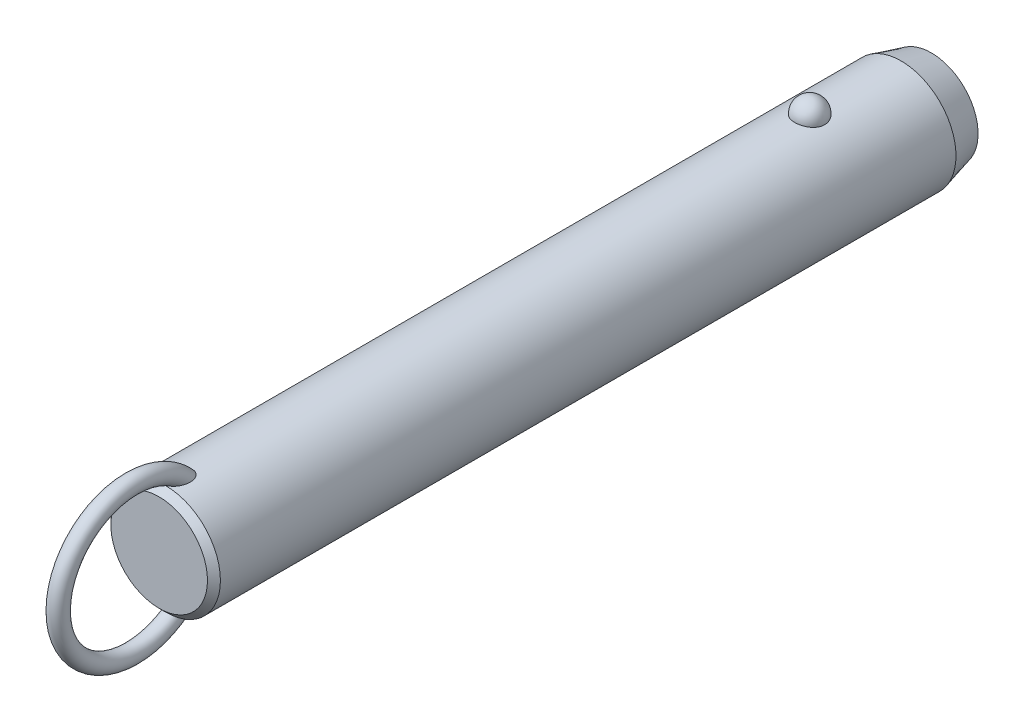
ISO-10303-21;
HEADER;
FILE_DESCRIPTION(('STEP AP214'),'2;1');
FILE_NAME('part.step','',(''),(''),'','','');
FILE_SCHEMA(('AUTOMOTIVE_DESIGN { 1 0 10303 214 1 1 1 1 }'));
ENDSEC;
DATA;
#1=APPLICATION_CONTEXT('core data for automotive mechanical design processes');
#2=APPLICATION_PROTOCOL_DEFINITION('international standard','automotive_design',2000,#1);
#3=PRODUCT_CONTEXT('',#1,'mechanical');
#4=PRODUCT('Part','Part','',(#3));
#5=PRODUCT_RELATED_PRODUCT_CATEGORY('part','',(#4));
#6=PRODUCT_DEFINITION_FORMATION('','',#4);
#7=PRODUCT_DEFINITION_CONTEXT('part definition',#1,'design');
#8=PRODUCT_DEFINITION('design','',#6,#7);
#9=PRODUCT_DEFINITION_SHAPE('','',#8);
#10=(LENGTH_UNIT() NAMED_UNIT(*) SI_UNIT(.MILLI.,.METRE.));
#11=(NAMED_UNIT(*) PLANE_ANGLE_UNIT() SI_UNIT($,.RADIAN.));
#12=(NAMED_UNIT(*) SI_UNIT($,.STERADIAN.) SOLID_ANGLE_UNIT());
#13=UNCERTAINTY_MEASURE_WITH_UNIT(LENGTH_MEASURE(1.E-05),#10,'distance_accuracy_value','');
#14=(GEOMETRIC_REPRESENTATION_CONTEXT(3) GLOBAL_UNCERTAINTY_ASSIGNED_CONTEXT((#13)) GLOBAL_UNIT_ASSIGNED_CONTEXT((#10,
#11,#12)) REPRESENTATION_CONTEXT('',''));
#15=CARTESIAN_POINT('',(0.,0.,0.));
#16=DIRECTION('',(0.,0.,1.));
#17=DIRECTION('',(1.,0.,0.));
#18=AXIS2_PLACEMENT_3D('',#15,#16,#17);
#19=CARTESIAN_POINT('',(0.,0.,134.6));
#20=DIRECTION('',(0.,0.,-1.));
#21=DIRECTION('',(-1.,0.,0.));
#22=AXIS2_PLACEMENT_3D('',#19,#20,#21);
#23=CYLINDRICAL_SURFACE('',#22,12.7);
#24=CARTESIAN_POINT('',(3.46661256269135,12.2177165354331,-3.5));
#25=CARTESIAN_POINT('',(3.4666090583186,12.2177194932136,-3.30432790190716));
#26=CARTESIAN_POINT('',(3.45063567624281,12.2222841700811,-3.10861112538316));
#27=CARTESIAN_POINT('',(3.38712451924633,12.2400345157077,-2.72271899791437));
#28=CARTESIAN_POINT('',(3.33957415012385,12.2532236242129,-2.53254588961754));
#29=CARTESIAN_POINT('',(3.2141234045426,12.286724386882,-2.16324948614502));
#30=CARTESIAN_POINT('',(3.13623639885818,12.3070329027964,-1.98412136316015));
#31=CARTESIAN_POINT('',(2.95205930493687,12.3525018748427,-1.64180592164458));
#32=CARTESIAN_POINT('',(2.84577003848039,12.3776621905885,-1.47861814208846));
#33=CARTESIAN_POINT('',(2.60688050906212,12.4301712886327,-1.17190583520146));
#34=CARTESIAN_POINT('',(2.47415697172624,12.4575299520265,-1.02847897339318));
#35=CARTESIAN_POINT('',(2.18615174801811,12.5112810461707,-0.766177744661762));
#36=CARTESIAN_POINT('',(2.03087002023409,12.5376734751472,-0.64730342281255));
#37=CARTESIAN_POINT('',(1.70237334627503,12.5864761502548,-0.437732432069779));
#38=CARTESIAN_POINT('',(1.52920948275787,12.6088972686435,-0.346958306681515));
#39=CARTESIAN_POINT('',(1.16944170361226,12.6473352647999,-0.195750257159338));
#40=CARTESIAN_POINT('',(0.982839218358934,12.663352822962,-0.135313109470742));
#41=CARTESIAN_POINT('',(0.604961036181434,12.6869706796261,-0.0473241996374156));
#42=CARTESIAN_POINT('',(0.41382314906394,12.6947125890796,-0.0192185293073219));
#43=CARTESIAN_POINT('',(0.0293827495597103,12.7014203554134,0.0051725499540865));
#44=CARTESIAN_POINT('',(-0.163919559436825,12.7003870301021,0.00146092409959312));
#45=CARTESIAN_POINT('',(-0.544374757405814,12.689735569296,-0.0373939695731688));
#46=CARTESIAN_POINT('',(-0.731575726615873,12.6802364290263,-0.0721015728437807));
#47=CARTESIAN_POINT('',(-1.09733277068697,12.6538333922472,-0.171364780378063));
#48=CARTESIAN_POINT('',(-1.27588869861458,12.6369293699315,-0.235920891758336));
#49=CARTESIAN_POINT('',(-1.6204698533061,12.5973946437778,-0.393548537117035));
#50=CARTESIAN_POINT('',(-1.78641865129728,12.5747321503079,-0.486778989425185));
#51=CARTESIAN_POINT('',(-2.10030671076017,12.5261316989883,-0.699110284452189));
#52=CARTESIAN_POINT('',(-2.24824419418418,12.5001934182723,-0.818213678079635));
#53=CARTESIAN_POINT('',(-2.52491489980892,12.4472906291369,-1.08157124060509));
#54=CARTESIAN_POINT('',(-2.65324222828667,12.4203160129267,-1.22624992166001));
#55=CARTESIAN_POINT('',(-2.88410007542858,12.3687509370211,-1.53528325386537));
#56=CARTESIAN_POINT('',(-2.98662883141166,12.3441606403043,-1.69963924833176));
#57=CARTESIAN_POINT('',(-3.16432417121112,12.2998199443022,-2.04548497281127));
#58=CARTESIAN_POINT('',(-3.23917525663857,12.2801261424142,-2.22714424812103));
#59=CARTESIAN_POINT('',(-3.35800573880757,12.248167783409,-2.6009138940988));
#60=CARTESIAN_POINT('',(-3.4019860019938,12.2359030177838,-2.79302397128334));
#61=CARTESIAN_POINT('',(-3.45784812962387,12.2202347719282,-3.18140279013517));
#62=CARTESIAN_POINT('',(-3.46986123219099,12.2167950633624,-3.37765118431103));
#63=CARTESIAN_POINT('',(-3.46186273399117,12.2190638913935,-3.76943689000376));
#64=CARTESIAN_POINT('',(-3.44185196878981,12.2247721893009,-3.96497421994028));
#65=CARTESIAN_POINT('',(-3.37048652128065,12.2446381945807,-4.34881728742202));
#66=CARTESIAN_POINT('',(-3.31928253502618,12.2587552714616,-4.53715319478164));
#67=CARTESIAN_POINT('',(-3.18693461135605,12.2938237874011,-4.90231727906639));
#68=CARTESIAN_POINT('',(-3.1057895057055,12.3147754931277,-5.07914500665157));
#69=CARTESIAN_POINT('',(-2.91506431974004,12.3613125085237,-5.41732059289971));
#70=CARTESIAN_POINT('',(-2.80533587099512,12.3869217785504,-5.57858147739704));
#71=CARTESIAN_POINT('',(-2.560414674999,12.4398525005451,-5.88013283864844));
#72=CARTESIAN_POINT('',(-2.42522099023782,12.4671740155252,-6.02042254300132));
#73=CARTESIAN_POINT('',(-2.1323357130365,12.5205965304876,-6.27662798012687));
#74=CARTESIAN_POINT('',(-1.97456596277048,12.5466928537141,-6.3924554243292));
#75=CARTESIAN_POINT('',(-1.64115839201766,12.5946384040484,-6.59583547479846));
#76=CARTESIAN_POINT('',(-1.46552179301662,12.6164879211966,-6.68339001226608));
#77=CARTESIAN_POINT('',(-1.10356050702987,12.6532533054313,-6.82682153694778));
#78=CARTESIAN_POINT('',(-0.9173913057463,12.6682500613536,-6.8830698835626));
#79=CARTESIAN_POINT('',(-0.537836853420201,12.6900288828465,-6.96386887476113));
#80=CARTESIAN_POINT('',(-0.344452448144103,12.6968119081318,-6.9884232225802));
#81=CARTESIAN_POINT('',(0.0402577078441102,12.7013667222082,-7.00496469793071));
#82=CARTESIAN_POINT('',(0.231556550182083,12.6993008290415,-6.99753844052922));
#83=CARTESIAN_POINT('',(0.610105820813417,12.6867505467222,-6.9516636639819));
#84=CARTESIAN_POINT('',(0.797356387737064,12.6762664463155,-6.913216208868));
#85=CARTESIAN_POINT('',(1.16186657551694,12.6480587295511,-6.80658431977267));
#86=CARTESIAN_POINT('',(1.33915951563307,12.6303611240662,-6.73850666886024));
#87=CARTESIAN_POINT('',(1.67968518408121,12.5896027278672,-6.5745087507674));
#88=CARTESIAN_POINT('',(1.84291705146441,12.5665416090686,-6.47858678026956));
#89=CARTESIAN_POINT('',(2.15340192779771,12.5171072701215,-6.25982455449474));
#90=CARTESIAN_POINT('',(2.30037831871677,12.4906895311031,-6.13660186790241));
#91=CARTESIAN_POINT('',(2.5717412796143,12.4376567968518,-5.86739587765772));
#92=CARTESIAN_POINT('',(2.69612388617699,12.4110417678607,-5.72140858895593));
#93=CARTESIAN_POINT('',(2.92107785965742,12.360051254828,-5.40794137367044));
#94=CARTESIAN_POINT('',(3.02121329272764,12.3357209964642,-5.24014110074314));
#95=CARTESIAN_POINT('',(3.19236291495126,12.2925446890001,-4.88969865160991));
#96=CARTESIAN_POINT('',(3.26338839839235,12.2736965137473,-4.70706226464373));
#97=CARTESIAN_POINT('',(3.36788038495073,12.245404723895,-4.35469510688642));
#98=CARTESIAN_POINT('',(3.40484026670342,12.2351018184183,-4.18605935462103));
#99=CARTESIAN_POINT('',(3.45420764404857,12.2212564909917,-3.84496058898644));
#100=CARTESIAN_POINT('',(3.46661565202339,12.2177139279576,-3.67249765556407));
#101=CARTESIAN_POINT('',(3.46661256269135,12.2177165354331,-3.5));
#102=B_SPLINE_CURVE_WITH_KNOTS('',3,(#24,#25,#26,#27,#28,#29,#30,#31,#32,#33,#34,#35,#36,#37,
#38,#39,#40,#41,#42,#43,#44,#45,#46,#47,#48,#49,#50,#51,#52,#53,#54,#55,#56,#57,#58,#59,#60,#61,
#62,#63,#64,#65,#66,#67,#68,#69,#70,#71,#72,#73,#74,#75,#76,#77,#78,#79,#80,#81,#82,#83,#84,#85,
#86,#87,#88,#89,#90,#91,#92,#93,#94,#95,#96,#97,#98,#99,#100,#101),.UNSPECIFIED.,.T.,.F.,(4,2,2,
2,2,2,2,2,2,2,2,2,2,2,2,2,2,2,2,2,2,2,2,2,2,2,2,2,2,2,2,2,2,2,2,2,2,2,4),(0.,0.586396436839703,
1.17302689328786,1.7593990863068,2.34575431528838,2.93491084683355,3.52406845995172,
4.11158733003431,4.69904375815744,5.2762784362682,5.85345931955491,6.42265312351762,
6.99185659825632,7.56427334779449,8.136746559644,8.71981013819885,9.3029135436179,
9.89247258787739,10.4820150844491,11.0691335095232,11.6562366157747,12.2405256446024,
12.8248374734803,13.412244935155,13.9996740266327,14.5891883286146,15.1786623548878,
15.7609861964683,16.3432419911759,16.9148635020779,17.4864654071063,18.0560241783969,
18.6256177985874,19.2037609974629,19.7820055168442,20.3699810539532,20.957728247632,
21.4746855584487,21.9916320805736),.UNSPECIFIED.);
#103=CARTESIAN_POINT('',(3.46661256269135,12.2177165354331,-3.5));
#104=VERTEX_POINT('',#103);
#105=EDGE_CURVE('E41',#104,#104,#102,.T.);
#106=ORIENTED_EDGE('',*,*,#105,.T.);
#107=EDGE_LOOP('',(#106));
#108=FACE_BOUND('',#107,.T.);
#109=CARTESIAN_POINT('',(0.,0.,145.8));
#110=DIRECTION('',(0.,0.,1.));
#111=DIRECTION('',(1.,0.,0.));
#112=AXIS2_PLACEMENT_3D('',#109,#110,#111);
#113=CIRCLE('',#112,12.7);
#114=CARTESIAN_POINT('',(12.7,0.,145.8));
#115=VERTEX_POINT('',#114);
#116=EDGE_CURVE('E10',#115,#115,#113,.F.);
#117=ORIENTED_EDGE('',*,*,#116,.T.);
#118=EDGE_LOOP('',(#117));
#119=FACE_BOUND('',#118,.T.);
#120=CARTESIAN_POINT('',(-0.548122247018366,-12.6881662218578,139.543218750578));
#121=CARTESIAN_POINT('',(-0.648865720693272,-12.6838128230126,139.577926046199));
#122=CARTESIAN_POINT('',(-0.746398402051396,-12.6783867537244,139.622042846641));
#123=CARTESIAN_POINT('',(-0.932125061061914,-12.666091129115,139.726764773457));
#124=CARTESIAN_POINT('',(-1.02030388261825,-12.6592192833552,139.787396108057));
#125=CARTESIAN_POINT('',(-1.18487740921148,-12.6448747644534,139.921847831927));
#126=CARTESIAN_POINT('',(-1.26134296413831,-12.637406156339,139.995582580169));
#127=CARTESIAN_POINT('',(-1.4023120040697,-12.6225412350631,140.153604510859));
#128=CARTESIAN_POINT('',(-1.466814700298,-12.6151449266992,140.23789238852));
#129=CARTESIAN_POINT('',(-1.60714786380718,-12.5981718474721,140.449657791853));
#130=CARTESIAN_POINT('',(-1.67725126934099,-12.588900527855,140.580962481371));
#131=CARTESIAN_POINT('',(-1.79536591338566,-12.5725964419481,140.853247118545));
#132=CARTESIAN_POINT('',(-1.84333535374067,-12.5655679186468,140.994244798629));
#133=CARTESIAN_POINT('',(-1.93422576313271,-12.5519624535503,141.337645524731));
#134=CARTESIAN_POINT('',(-1.96788773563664,-12.5466298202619,141.542557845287));
#135=CARTESIAN_POINT('',(-1.9941399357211,-12.542463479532,141.851760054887));
#136=CARTESIAN_POINT('',(-1.99883864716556,-12.5417153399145,141.955298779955));
#137=CARTESIAN_POINT('',(-2.00078003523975,-12.5414074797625,142.16245124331));
#138=CARTESIAN_POINT('',(-1.99802449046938,-12.5418474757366,142.266064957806));
#139=CARTESIAN_POINT('',(-1.98336733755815,-12.5441750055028,142.51032076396));
#140=CARTESIAN_POINT('',(-1.96851430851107,-12.5465291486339,142.650780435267));
#141=CARTESIAN_POINT('',(-1.92707089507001,-12.5529612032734,142.929960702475));
#142=CARTESIAN_POINT('',(-1.90047458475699,-12.5570399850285,143.068680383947));
#143=CARTESIAN_POINT('',(-1.8361912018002,-12.5666008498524,143.34341135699));
#144=CARTESIAN_POINT('',(-1.79850828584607,-12.57208240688,143.479423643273));
#145=CARTESIAN_POINT('',(-1.71223796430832,-12.5841228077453,143.747842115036));
#146=CARTESIAN_POINT('',(-1.66365679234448,-12.5906810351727,143.880250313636));
#147=CARTESIAN_POINT('',(-1.5780450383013,-12.6016176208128,144.08548877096));
#148=CARTESIAN_POINT('',(-1.54477252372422,-12.6057501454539,144.159914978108));
#149=CARTESIAN_POINT('',(-1.47424480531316,-12.6141930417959,144.306839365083));
#150=CARTESIAN_POINT('',(-1.436990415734,-12.6185033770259,144.379337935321));
#151=CARTESIAN_POINT('',(-1.35825795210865,-12.6272207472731,144.521892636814));
#152=CARTESIAN_POINT('',(-1.31678520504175,-12.6316276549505,144.591951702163));
#153=CARTESIAN_POINT('',(-1.22917793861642,-12.6404532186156,144.729070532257));
#154=CARTESIAN_POINT('',(-1.18304514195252,-12.6448718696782,144.796131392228));
#155=CARTESIAN_POINT('',(-1.0724641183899,-12.6547893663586,144.943874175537));
#156=CARTESIAN_POINT('',(-1.00642239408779,-12.6602600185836,145.023384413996));
#157=CARTESIAN_POINT('',(-0.864441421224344,-12.6707460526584,145.173169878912));
#158=CARTESIAN_POINT('',(-0.78851691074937,-12.6757620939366,145.243458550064));
#159=CARTESIAN_POINT('',(-0.65221547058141,-12.6833591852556,145.348680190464));
#160=CARTESIAN_POINT('',(-0.59498203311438,-12.6861973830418,145.387624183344));
#161=CARTESIAN_POINT('',(-0.475269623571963,-12.6912445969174,145.456489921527));
#162=CARTESIAN_POINT('',(-0.412800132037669,-12.6934547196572,145.486427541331));
#163=CARTESIAN_POINT('',(-0.295749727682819,-12.6966636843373,145.52975652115));
#164=CARTESIAN_POINT('',(-0.241949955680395,-12.6978134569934,145.545218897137));
#165=CARTESIAN_POINT('',(-0.132508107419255,-12.6994261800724,145.566884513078));
#166=CARTESIAN_POINT('',(-0.0768679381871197,-12.6998898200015,145.573097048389));
#167=CARTESIAN_POINT('',(0.03476966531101,-12.7000752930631,145.575583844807));
#168=CARTESIAN_POINT('',(0.0907676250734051,-12.6997954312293,145.571835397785));
#169=CARTESIAN_POINT('',(0.201283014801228,-12.6985255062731,145.554788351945));
#170=CARTESIAN_POINT('',(0.255799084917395,-12.6975348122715,145.541481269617));
#171=CARTESIAN_POINT('',(0.376042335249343,-12.6946091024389,145.50203792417));
#172=CARTESIAN_POINT('',(0.440950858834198,-12.6924943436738,145.473449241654));
#173=CARTESIAN_POINT('',(0.565350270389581,-12.6875639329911,145.406323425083));
#174=CARTESIAN_POINT('',(0.624828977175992,-12.6847467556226,145.367764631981));
#175=CARTESIAN_POINT('',(0.774116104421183,-12.6767252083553,145.256949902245));
#176=CARTESIAN_POINT('',(0.859449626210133,-12.6711344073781,145.178760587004));
#177=CARTESIAN_POINT('',(1.01789440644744,-12.6593922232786,145.010943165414));
#178=CARTESIAN_POINT('',(1.09096902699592,-12.653239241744,144.921282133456));
#179=CARTESIAN_POINT('',(1.22268793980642,-12.6411674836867,144.740265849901));
#180=CARTESIAN_POINT('',(1.28193986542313,-12.6352572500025,144.649345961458));
#181=CARTESIAN_POINT('',(1.39259777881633,-12.6235401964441,144.462792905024));
#182=CARTESIAN_POINT('',(1.44399707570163,-12.6177334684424,144.367155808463));
#183=CARTESIAN_POINT('',(1.53972870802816,-12.6064093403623,144.172273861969));
#184=CARTESIAN_POINT('',(1.58405262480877,-12.6008922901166,144.073024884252));
#185=CARTESIAN_POINT('',(1.66600705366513,-12.5903187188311,143.871772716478));
#186=CARTESIAN_POINT('',(1.70363651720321,-12.5852622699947,143.769769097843));
#187=CARTESIAN_POINT('',(1.77545379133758,-12.5753406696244,143.554358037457));
#188=CARTESIAN_POINT('',(1.80903453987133,-12.5705328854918,143.440745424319));
#189=CARTESIAN_POINT('',(1.86844163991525,-12.5618400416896,143.211457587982));
#190=CARTESIAN_POINT('',(1.89426665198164,-12.5579551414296,143.095782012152));
#191=CARTESIAN_POINT('',(1.9378546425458,-12.5513030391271,142.863007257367));
#192=CARTESIAN_POINT('',(1.9556264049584,-12.5485346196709,142.745909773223));
#193=CARTESIAN_POINT('',(1.98264463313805,-12.5442934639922,142.510747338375));
#194=CARTESIAN_POINT('',(1.99189298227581,-12.5428204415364,142.39268260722));
#195=CARTESIAN_POINT('',(2.00416068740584,-12.540871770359,142.080622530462));
#196=CARTESIAN_POINT('',(1.99944433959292,-12.541631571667,141.886229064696));
#197=CARTESIAN_POINT('',(1.96113755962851,-12.5476846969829,141.500309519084));
#198=CARTESIAN_POINT('',(1.92758341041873,-12.5529723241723,141.308780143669));
#199=CARTESIAN_POINT('',(1.83934342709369,-12.5661532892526,140.982272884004));
#200=CARTESIAN_POINT('',(1.79215440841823,-12.5730485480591,140.84524997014));
#201=CARTESIAN_POINT('',(1.67676242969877,-12.588958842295,140.580445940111));
#202=CARTESIAN_POINT('',(1.60859050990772,-12.597970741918,140.452651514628));
#203=CARTESIAN_POINT('',(1.46583832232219,-12.6152829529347,140.235800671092));
#204=CARTESIAN_POINT('',(1.39525727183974,-12.6233659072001,140.14410500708));
#205=CARTESIAN_POINT('',(1.23992594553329,-12.6395676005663,139.973485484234));
#206=CARTESIAN_POINT('',(1.15517932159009,-12.6476863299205,139.894558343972));
#207=CARTESIAN_POINT('',(0.971995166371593,-12.6630846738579,139.752643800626));
#208=CARTESIAN_POINT('',(0.873456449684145,-12.6703572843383,139.689784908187));
#209=CARTESIAN_POINT('',(0.665847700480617,-12.6829569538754,139.584487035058));
#210=CARTESIAN_POINT('',(0.556784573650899,-12.688285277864,139.542034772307));
#211=CARTESIAN_POINT('',(0.347338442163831,-12.6956226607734,139.484443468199));
#212=CARTESIAN_POINT('',(0.247759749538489,-12.6979816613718,139.466399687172));
#213=CARTESIAN_POINT('',(0.0470218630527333,-12.7003077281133,139.448600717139));
#214=CARTESIAN_POINT('',(-0.0541350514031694,-12.7002779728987,139.448821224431));
#215=CARTESIAN_POINT('',(-0.221414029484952,-12.6982482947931,139.464363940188));
#216=CARTESIAN_POINT('',(-0.288055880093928,-12.6969033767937,139.474666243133));
#217=CARTESIAN_POINT('',(-0.419599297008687,-12.6932369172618,139.50313489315));
#218=CARTESIAN_POINT('',(-0.484501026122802,-12.6909154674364,139.521300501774));
#219=CARTESIAN_POINT('',(-0.548122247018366,-12.6881662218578,139.543218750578));
#220=B_SPLINE_CURVE_WITH_KNOTS('',3,(#120,#121,#122,#123,#124,#125,#126,#127,#128,#129,#130,
#131,#132,#133,#134,#135,#136,#137,#138,#139,#140,#141,#142,#143,#144,#145,#146,#147,#148,#149,
#150,#151,#152,#153,#154,#155,#156,#157,#158,#159,#160,#161,#162,#163,#164,#165,#166,#167,#168,
#169,#170,#171,#172,#173,#174,#175,#176,#177,#178,#179,#180,#181,#182,#183,#184,#185,#186,#187,
#188,#189,#190,#191,#192,#193,#194,#195,#196,#197,#198,#199,#200,#201,#202,#203,#204,#205,#206,
#207,#208,#209,#210,#211,#212,#213,#214,#215,#216,#217,#218,#219),.UNSPECIFIED.,.T.,.F.,(4,2,2,
2,2,2,2,2,2,2,2,2,2,2,2,2,2,2,2,2,2,2,2,2,2,2,2,2,2,2,2,2,2,2,2,2,2,2,2,2,2,2,2,2,2,2,2,2,2,4),
(0.,0.31964225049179,0.639794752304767,0.957927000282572,1.27608021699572,1.72100165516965,
2.16675988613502,2.78630021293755,3.09705782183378,3.40774128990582,3.83096358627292,
4.25439969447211,4.67767724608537,5.10071330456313,5.34550297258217,5.59024267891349,
5.83467707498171,6.07902143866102,6.38891080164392,6.69834321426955,6.9056091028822,
7.11250749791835,7.27977315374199,7.44687060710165,7.61434932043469,7.78197685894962,
7.99365544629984,8.20579780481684,8.55147335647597,8.89816429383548,9.22375138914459,
9.54961437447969,9.8758622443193,10.202161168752,10.557587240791,10.9130746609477,
11.2681734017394,11.6231936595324,12.2046601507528,12.7853961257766,13.219164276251,
13.6522938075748,13.9989174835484,14.3454519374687,14.6946768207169,15.0436740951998,
15.3457513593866,15.6474266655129,15.8493051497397,16.0511646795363),.UNSPECIFIED.);
#221=CARTESIAN_POINT('',(-0.548122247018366,-12.6881662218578,139.543218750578));
#222=VERTEX_POINT('',#221);
#223=EDGE_CURVE('E59',#222,#222,#220,.T.);
#224=ORIENTED_EDGE('',*,*,#223,.T.);
#225=EDGE_LOOP('',(#224));
#226=FACE_BOUND('',#225,.T.);
#227=CARTESIAN_POINT('',(-0.548122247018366,12.6881662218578,139.543218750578));
#228=CARTESIAN_POINT('',(-0.459436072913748,12.6919968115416,139.512673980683));
#229=CARTESIAN_POINT('',(-0.368189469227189,12.6949996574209,139.489391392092));
#230=CARTESIAN_POINT('',(-0.183024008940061,12.6990186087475,139.458406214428));
#231=CARTESIAN_POINT('',(-0.0891049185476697,12.7000345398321,139.450704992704));
#232=CARTESIAN_POINT('',(0.0987147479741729,12.6999636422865,139.451245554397));
#233=CARTESIAN_POINT('',(0.192615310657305,12.6988761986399,139.459492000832));
#234=CARTESIAN_POINT('',(0.377658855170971,12.6947211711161,139.491551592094));
#235=CARTESIAN_POINT('',(0.468801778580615,12.6916535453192,139.515365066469));
#236=CARTESIAN_POINT('',(0.645809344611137,12.6838788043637,139.57745651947));
#237=CARTESIAN_POINT('',(0.731679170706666,12.6791733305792,139.615720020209));
#238=CARTESIAN_POINT('',(0.896315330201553,12.6686004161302,139.705120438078));
#239=CARTESIAN_POINT('',(0.97508059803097,12.6627328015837,139.756259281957));
#240=CARTESIAN_POINT('',(1.12963655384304,12.6499161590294,139.87367820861));
#241=CARTESIAN_POINT('',(1.20478673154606,12.6429194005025,139.940792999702));
#242=CARTESIAN_POINT('',(1.34448241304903,12.6288282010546,140.08522507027));
#243=CARTESIAN_POINT('',(1.40902173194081,12.621733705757,140.162548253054));
#244=CARTESIAN_POINT('',(1.55208211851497,12.6050877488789,140.359247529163));
#245=CARTESIAN_POINT('',(1.62510490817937,12.5957546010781,140.482654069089));
#246=CARTESIAN_POINT('',(1.7501904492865,12.5789823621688,140.739769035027));
#247=CARTESIAN_POINT('',(1.8022137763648,12.5715468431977,140.873496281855));
#248=CARTESIAN_POINT('',(1.90309965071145,12.5567434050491,141.198351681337));
#249=CARTESIAN_POINT('',(1.94342317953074,12.5504515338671,141.392161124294));
#250=CARTESIAN_POINT('',(1.99332997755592,12.5426147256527,141.78378810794));
#251=CARTESIAN_POINT('',(2.00285305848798,12.5410790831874,141.981612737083));
#252=CARTESIAN_POINT('',(1.99678999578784,12.5420407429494,142.316642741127));
#253=CARTESIAN_POINT('',(1.98794117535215,12.5434564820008,142.454042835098));
#254=CARTESIAN_POINT('',(1.95865119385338,12.5480641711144,142.727639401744));
#255=CARTESIAN_POINT('',(1.93820436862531,12.5512569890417,142.863835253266));
#256=CARTESIAN_POINT('',(1.88647896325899,12.5591352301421,143.134249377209));
#257=CARTESIAN_POINT('',(1.85518800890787,12.5638223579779,143.268465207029));
#258=CARTESIAN_POINT('',(1.78217886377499,12.5743868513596,143.533936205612));
#259=CARTESIAN_POINT('',(1.74046509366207,12.5802637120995,143.665192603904));
#260=CARTESIAN_POINT('',(1.66024095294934,12.5910571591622,143.886085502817));
#261=CARTESIAN_POINT('',(1.62434772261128,12.5957535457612,143.976690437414));
#262=CARTESIAN_POINT('',(1.54709009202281,12.6054762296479,144.155512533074));
#263=CARTESIAN_POINT('',(1.50572681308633,12.6105024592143,144.243730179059));
#264=CARTESIAN_POINT('',(1.41728020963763,12.620748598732,144.416932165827));
#265=CARTESIAN_POINT('',(1.37021377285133,12.625967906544,144.501925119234));
#266=CARTESIAN_POINT('',(1.26969620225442,12.6364721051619,144.668007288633));
#267=CARTESIAN_POINT('',(1.21624929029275,12.6417569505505,144.749099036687));
#268=CARTESIAN_POINT('',(1.10304413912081,12.6521331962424,144.904702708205));
#269=CARTESIAN_POINT('',(1.04340936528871,12.657226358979,144.979303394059));
#270=CARTESIAN_POINT('',(0.915919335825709,12.667090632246,145.121324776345));
#271=CARTESIAN_POINT('',(0.848064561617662,12.6718617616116,145.18874589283));
#272=CARTESIAN_POINT('',(0.717035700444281,12.67987711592,145.300624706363));
#273=CARTESIAN_POINT('',(0.655526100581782,12.6832377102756,145.346997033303));
#274=CARTESIAN_POINT('',(0.525985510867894,12.6892676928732,145.429619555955));
#275=CARTESIAN_POINT('',(0.457969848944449,12.6919386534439,145.465892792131));
#276=CARTESIAN_POINT('',(0.334859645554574,12.695691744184,145.516657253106));
#277=CARTESIAN_POINT('',(0.281116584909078,12.6970073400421,145.534373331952));
#278=CARTESIAN_POINT('',(0.171425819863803,12.6989609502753,145.560642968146));
#279=CARTESIAN_POINT('',(0.115480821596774,12.699599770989,145.569207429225));
#280=CARTESIAN_POINT('',(0.00272618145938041,12.7001251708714,145.576253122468));
#281=CARTESIAN_POINT('',(-0.0540859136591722,12.7000089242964,145.574696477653));
#282=CARTESIAN_POINT('',(-0.16654462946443,12.6990328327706,145.561600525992));
#283=CARTESIAN_POINT('',(-0.222190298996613,12.6981724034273,145.550053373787));
#284=CARTESIAN_POINT('',(-0.342018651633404,12.695562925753,145.514912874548));
#285=CARTESIAN_POINT('',(-0.405606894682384,12.6936676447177,145.48933225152));
#286=CARTESIAN_POINT('',(-0.527815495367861,12.6891754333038,145.428311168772));
#287=CARTESIAN_POINT('',(-0.586425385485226,12.6865770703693,145.392850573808));
#288=CARTESIAN_POINT('',(-0.731842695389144,12.6792129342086,145.291496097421));
#289=CARTESIAN_POINT('',(-0.81470941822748,12.6740767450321,145.2200395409));
#290=CARTESIAN_POINT('',(-0.969101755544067,12.6632083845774,145.06589007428));
#291=CARTESIAN_POINT('',(-1.04059564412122,12.6574746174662,144.983166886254));
#292=CARTESIAN_POINT('',(-1.16981116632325,12.6461638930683,144.815809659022));
#293=CARTESIAN_POINT('',(-1.22811369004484,12.6405994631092,144.731616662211));
#294=CARTESIAN_POINT('',(-1.33743405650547,12.6295007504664,144.558579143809));
#295=CARTESIAN_POINT('',(-1.38844577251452,12.6239664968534,144.469730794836));
#296=CARTESIAN_POINT('',(-1.48400702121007,12.6130898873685,144.288389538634));
#297=CARTESIAN_POINT('',(-1.52854232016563,12.6077479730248,144.195889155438));
#298=CARTESIAN_POINT('',(-1.61150113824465,12.5974127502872,144.008160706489));
#299=CARTESIAN_POINT('',(-1.64992317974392,12.5924195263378,143.912931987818));
#300=CARTESIAN_POINT('',(-1.73468589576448,12.581070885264,143.68289362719));
#301=CARTESIAN_POINT('',(-1.77831261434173,12.5749388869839,143.547066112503));
#302=CARTESIAN_POINT('',(-1.85439734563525,12.5639437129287,143.272212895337));
#303=CARTESIAN_POINT('',(-1.88684994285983,12.5590811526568,143.133185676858));
#304=CARTESIAN_POINT('',(-1.94008483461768,12.550968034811,142.85309235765));
#305=CARTESIAN_POINT('',(-1.96088706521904,12.5477147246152,142.712030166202));
#306=CARTESIAN_POINT('',(-1.99000539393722,12.5431291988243,142.428668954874));
#307=CARTESIAN_POINT('',(-1.99832911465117,12.5417958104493,142.286370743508));
#308=CARTESIAN_POINT('',(-2.00166624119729,12.5412674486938,141.957627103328));
#309=CARTESIAN_POINT('',(-1.99178843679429,12.5428579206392,141.771088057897));
#310=CARTESIAN_POINT('',(-1.94455183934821,12.5502731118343,141.40162404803));
#311=CARTESIAN_POINT('',(-1.90724032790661,12.5560905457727,141.218693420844));
#312=CARTESIAN_POINT('',(-1.81330718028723,12.5699462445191,140.904848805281));
#313=CARTESIAN_POINT('',(-1.76338820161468,12.5771273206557,140.771910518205));
#314=CARTESIAN_POINT('',(-1.64305018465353,12.593414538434,140.515681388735));
#315=CARTESIAN_POINT('',(-1.57265346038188,12.6025185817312,140.392380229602));
#316=CARTESIAN_POINT('',(-1.42634956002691,12.6198178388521,140.183564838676));
#317=CARTESIAN_POINT('',(-1.35423772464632,12.6278405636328,140.095384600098));
#318=CARTESIAN_POINT('',(-1.19645664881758,12.6437632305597,139.932107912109));
#319=CARTESIAN_POINT('',(-1.1108053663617,12.6516633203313,139.856994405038));
#320=CARTESIAN_POINT('',(-0.947219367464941,12.6648319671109,139.737811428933));
#321=CARTESIAN_POINT('',(-0.871624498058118,12.670300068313,139.690541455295));
#322=CARTESIAN_POINT('',(-0.714161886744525,12.6801492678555,139.6077413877));
#323=CARTESIAN_POINT('',(-0.632295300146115,12.684530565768,139.57220913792));
#324=CARTESIAN_POINT('',(-0.548122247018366,12.6881662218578,139.543218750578));
#325=B_SPLINE_CURVE_WITH_KNOTS('',3,(#227,#228,#229,#230,#231,#232,#233,#234,#235,#236,#237,
#238,#239,#240,#241,#242,#243,#244,#245,#246,#247,#248,#249,#250,#251,#252,#253,#254,#255,#256,
#257,#258,#259,#260,#261,#262,#263,#264,#265,#266,#267,#268,#269,#270,#271,#272,#273,#274,#275,
#276,#277,#278,#279,#280,#281,#282,#283,#284,#285,#286,#287,#288,#289,#290,#291,#292,#293,#294,
#295,#296,#297,#298,#299,#300,#301,#302,#303,#304,#305,#306,#307,#308,#309,#310,#311,#312,#313,
#314,#315,#316,#317,#318,#319,#320,#321,#322,#323,#324),.UNSPECIFIED.,.T.,.F.,(4,2,2,2,2,2,2,2,
2,2,2,2,2,2,2,2,2,2,2,2,2,2,2,2,2,2,2,2,2,2,2,2,2,2,2,2,2,2,2,2,2,2,2,2,2,2,2,2,4),(0.,
0.281328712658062,0.562682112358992,0.844117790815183,1.12555942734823,1.40671982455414,
1.68792232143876,1.98972294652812,2.29169886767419,2.72039860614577,3.14989948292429,
3.74084916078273,4.33295293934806,4.74554109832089,5.15833092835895,5.57159335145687,
5.98468079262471,6.27722775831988,6.56971484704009,6.86135609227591,7.15280542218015,
7.43927407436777,7.72572595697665,7.95635862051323,8.18646071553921,8.35559393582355,
8.52452541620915,8.69408946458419,8.86378678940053,9.06834348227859,9.27332014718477,
9.60010414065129,9.92778432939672,10.2350252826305,10.5425229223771,10.8506864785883,
11.15892440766,11.5867893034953,12.0148612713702,12.4421984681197,12.8692745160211,
13.4279365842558,13.9856380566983,14.4107062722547,14.835313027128,15.1765567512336,
15.517351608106,15.7844129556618,16.051425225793),.UNSPECIFIED.);
#326=CARTESIAN_POINT('',(-0.548122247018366,12.6881662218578,139.543218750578));
#327=VERTEX_POINT('',#326);
#328=EDGE_CURVE('E67',#327,#327,#325,.T.);
#329=ORIENTED_EDGE('',*,*,#328,.T.);
#330=EDGE_LOOP('',(#329));
#331=FACE_BOUND('',#330,.T.);
#332=CARTESIAN_POINT('',(0.,0.,-24.6999999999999));
#333=DIRECTION('',(0.,0.,-1.));
#334=DIRECTION('',(-1.,0.,0.));
#335=AXIS2_PLACEMENT_3D('',#332,#333,#334);
#336=CIRCLE('',#335,12.7);
#337=CARTESIAN_POINT('',(-12.7,0.,-24.6999999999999));
#338=VERTEX_POINT('',#337);
#339=EDGE_CURVE('E56',#338,#338,#336,.F.);
#340=ORIENTED_EDGE('',*,*,#339,.T.);
#341=EDGE_LOOP('',(#340));
#342=FACE_BOUND('',#341,.T.);
#343=ADVANCED_FACE('F37',(#108,#119,#226,#331,#342),#23,.T.);
#344=CARTESIAN_POINT('',(0.,0.,-31.7));
#345=DIRECTION('',(0.,0.,-1.));
#346=DIRECTION('',(-1.,0.,0.));
#347=AXIS2_PLACEMENT_3D('',#344,#345,#346);
#348=PLANE('',#347);
#349=CARTESIAN_POINT('',(0.,0.,-31.7));
#350=DIRECTION('',(0.,0.,-1.));
#351=DIRECTION('',(-1.,0.,0.));
#352=AXIS2_PLACEMENT_3D('',#349,#350,#351);
#353=CIRCLE('',#352,10.8243556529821);
#354=CARTESIAN_POINT('',(-10.8243556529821,0.,-31.7));
#355=VERTEX_POINT('',#354);
#356=EDGE_CURVE('E66',#355,#355,#353,.T.);
#357=ORIENTED_EDGE('',*,*,#356,.T.);
#358=EDGE_LOOP('',(#357));
#359=FACE_BOUND('',#358,.T.);
#360=ADVANCED_FACE('F85',(#359),#348,.T.);
#361=CARTESIAN_POINT('',(0.,0.,-31.7));
#362=DIRECTION('',(0.,0.,1.));
#363=DIRECTION('',(1.,0.,0.));
#364=AXIS2_PLACEMENT_3D('',#361,#362,#363);
#365=CONICAL_SURFACE('',#364,10.8243556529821,0.261799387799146);
#366=ORIENTED_EDGE('',*,*,#339,.F.);
#367=EDGE_LOOP('',(#366));
#368=FACE_BOUND('',#367,.T.);
#369=ORIENTED_EDGE('',*,*,#356,.F.);
#370=EDGE_LOOP('',(#369));
#371=FACE_BOUND('',#370,.T.);
#372=ADVANCED_FACE('F83',(#368,#371),#365,.T.);
#373=CARTESIAN_POINT('',(0.,0.,147.3));
#374=DIRECTION('',(0.,0.,1.));
#375=DIRECTION('',(1.,0.,0.));
#376=AXIS2_PLACEMENT_3D('',#373,#374,#375);
#377=PLANE('',#376);
#378=CARTESIAN_POINT('',(0.,0.,147.3));
#379=DIRECTION('',(0.,0.,1.));
#380=DIRECTION('',(1.,0.,0.));
#381=AXIS2_PLACEMENT_3D('',#378,#379,#380);
#382=CIRCLE('',#381,11.2);
#383=CARTESIAN_POINT('',(11.2,0.,147.3));
#384=VERTEX_POINT('',#383);
#385=EDGE_CURVE('E50',#384,#384,#382,.T.);
#386=ORIENTED_EDGE('',*,*,#385,.T.);
#387=EDGE_LOOP('',(#386));
#388=FACE_BOUND('',#387,.T.);
#389=ADVANCED_FACE('F77',(#388),#377,.T.);
#390=CARTESIAN_POINT('',(0.,0.,153.65));
#391=DIRECTION('',(1.,0.,0.));
#392=DIRECTION('',(0.,0.,-1.));
#393=AXIS2_PLACEMENT_3D('',#390,#391,#392);
#394=TOROIDAL_SURFACE('',#393,17.05,2.);
#395=ORIENTED_EDGE('',*,*,#328,.F.);
#396=EDGE_LOOP('',(#395));
#397=FACE_BOUND('',#396,.T.);
#398=ORIENTED_EDGE('',*,*,#223,.F.);
#399=EDGE_LOOP('',(#398));
#400=FACE_BOUND('',#399,.T.);
#401=ADVANCED_FACE('F73',(#397,#400),#394,.T.);
#402=CARTESIAN_POINT('',(0.,0.,147.3));
#403=DIRECTION('',(0.,0.,-1.));
#404=DIRECTION('',(-1.,0.,0.));
#405=AXIS2_PLACEMENT_3D('',#402,#403,#404);
#406=CONICAL_SURFACE('',#405,11.2,0.785398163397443);
#407=ORIENTED_EDGE('',*,*,#116,.F.);
#408=EDGE_LOOP('',(#407));
#409=FACE_BOUND('',#408,.T.);
#410=ORIENTED_EDGE('',*,*,#385,.F.);
#411=EDGE_LOOP('',(#410));
#412=FACE_BOUND('',#411,.T.);
#413=ADVANCED_FACE('F39',(#409,#412),#406,.T.);
#414=CARTESIAN_POINT('',(0.,12.7,-3.5));
#415=DIRECTION('',(0.,1.,0.));
#416=DIRECTION('',(0.,0.,-1.));
#417=AXIS2_PLACEMENT_3D('',#414,#415,#416);
#418=SPHERICAL_SURFACE('',#417,3.5);
#419=ORIENTED_EDGE('',*,*,#105,.F.);
#420=EDGE_LOOP('',(#419));
#421=FACE_BOUND('',#420,.T.);
#422=ADVANCED_FACE('F79',(#421),#418,.T.);
#423=CLOSED_SHELL('',(#343,#360,#372,#389,#401,#413,#422));
#424=MANIFOLD_SOLID_BREP('B2',#423);
#425=ADVANCED_BREP_SHAPE_REPRESENTATION('',(#18,#424),#14);
#426=SHAPE_DEFINITION_REPRESENTATION(#9,#425);
ENDSEC;
END-ISO-10303-21;
